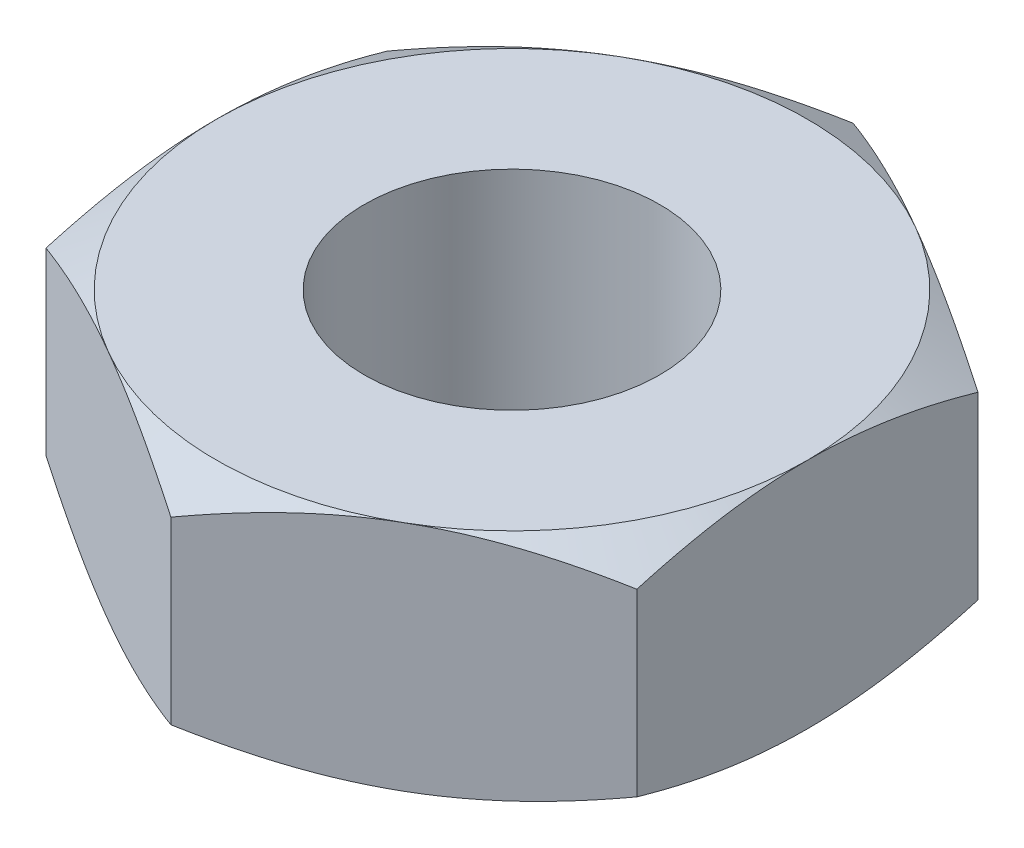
from build123d import *

# Parameters (mm, degrees)
BOSS_EXTRUDE1_DEPTH     = 5
SKETCH2_R               = 6.35
CUT_EXTRUDE1_DEPTH      = 22.82529114
SKETCH3_OUTSIDE_W       = 114.482
SKETCH3_OUTSIDE_H       = 118.412
SKETCH3_OUTSIDE_R       = 12.7
CUT_EXTRUDE2_DEPTH      = 22.82529114
CUT_EXTRUDE2_DRAFT      = -60
MIRROR1_COPY_1_SKETCH_W = 114.482
MIRROR1_COPY_1_SKETCH_H = 118.412
MIRROR1_COPY_1_SKETCH_R = 12.7
MIRROR1_COPY_1_DEPTH    = 22.82529114
MIRROR1_COPY_1_DRAFT    = -60


with BuildPart() as part:
    # Sketch1 → Boss-Extrude1 (new, symmetric)
    with BuildSketch(Plane(origin=(0, 0, 0), x_dir=(1, 0, 0), z_dir=(0, 1, 0))):
        Polygon((0, 14.664696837), (-12.7, 7.332348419), (-12.7, -7.332348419), (0, -14.664696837), (12.7, -7.332348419), (12.7, 7.332348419), align=None)
    extrude(amount=BOSS_EXTRUDE1_DEPTH, both=True)

    # Sketch2 → Cut-Extrude1 (cut, through all)
    with BuildSketch(Plane(origin=(0, 5, 0), x_dir=(1, 0, 0), z_dir=(0, 1, 0))):
        with Locations(Location((0, 0, 0), (0, 0, 270))):
            Circle(SKETCH2_R)
    extrude(amount=-CUT_EXTRUDE1_DEPTH, mode=Mode.SUBTRACT)


with BuildPart() as cut_extrude2_tool:
    # Sketch3 outside → Cut-Extrude2 (with draft: the straight prism first)
    with BuildSketch(Plane(origin=(0, 5, 0), x_dir=(1, 0, 0), z_dir=(0, 1, 0))):
        Rectangle(SKETCH3_OUTSIDE_W, SKETCH3_OUTSIDE_H)
        Circle(SKETCH3_OUTSIDE_R, mode=Mode.SUBTRACT)
    extrude(amount=-CUT_EXTRUDE2_DEPTH)
    # Cut-Extrude2: the draft: its side faces are tilted about the plane it starts from
    cut_extrude2_sides = [cut_extrude2_tool.faces().sort_by_distance(p)[0] for p in [
        (0, -6.41264557, 59.206),
        (57.241, -6.41264557, 0),
        (0, -6.41264557, -59.206),
        (-57.241, -6.41264557, 0),
        (-12.7, -6.41264557, 0),
    ]]
    draft(cut_extrude2_sides, Plane(origin=(0, 5, 0), x_dir=(1, 0, 0), z_dir=(0, 1, 0)), CUT_EXTRUDE2_DRAFT)


with BuildPart() as part_1:
    add(part.part)

    # Cut-Extrude2: cut by cut_extrude2_tool
    add(cut_extrude2_tool.part, mode=Mode.SUBTRACT)


with BuildPart() as mirror1_copy_1_tool:
    # Mirror1 copy 1 sketch → Mirror1 copy 1 (with draft: the straight prism first)
    with BuildSketch(Plane.XZ.offset(5)):
        Rectangle(MIRROR1_COPY_1_SKETCH_W, MIRROR1_COPY_1_SKETCH_H)
        Circle(MIRROR1_COPY_1_SKETCH_R, mode=Mode.SUBTRACT)
    extrude(amount=-MIRROR1_COPY_1_DEPTH)
    # Mirror1 copy 1: the draft: its side faces are tilted about the plane it starts from
    mirror1_copy_1_sides = [mirror1_copy_1_tool.faces().sort_by_distance(p)[0] for p in [
        (0, 6.41264557, 59.206),
        (57.241, 6.41264557, 0),
        (0, 6.41264557, -59.206),
        (-57.241, 6.41264557, 0),
        (-12.7, 6.41264557, 0),
    ]]
    draft(mirror1_copy_1_sides, Plane.XZ.offset(5), MIRROR1_COPY_1_DRAFT)


with BuildPart() as part_2:
    add(part_1.part)

    # Mirror1 copy 1: cut by mirror1_copy_1_tool
    add(mirror1_copy_1_tool.part, mode=Mode.SUBTRACT)


solid = part_2.part
